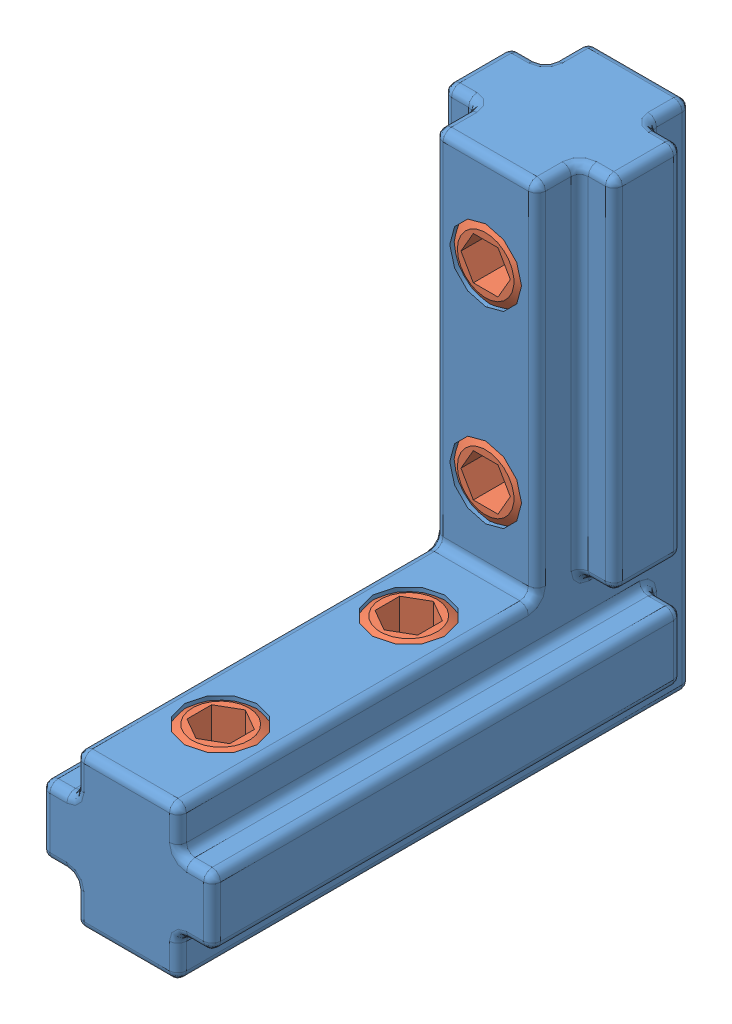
SolidWorks assembly J3RJ.SLDASM, configuration Default (file format 7000). Lengths in mm.
Overall size (10 30 30).
5 component instances, 2 part files, 8 mates.
Components (placement in the parent):
- J3RJ-1: J3RJ.SLDPRT [Default] at (-6.219 -10.7101 -13.0497) size (10 30 30)
- S0508-1: S0508.SLDPRT [Default] at (-9.219 13.7899 -4.0497) x (0 0 -1) z (1 0 0) size (8 5 5)
- S0508-2: S0508.SLDPRT [Default] at (-9.219 2.7899 -4.0497) x (0 0 -1) z (1 0 0) size (8 5 5)
- S0508-3: S0508.SLDPRT [Default] at (-9.219 -1.7101 0.4503) x (0 -1 0) z (0 0 1) size (8 5 5)
- S0508-4: S0508.SLDPRT [Default] at (-9.219 -1.7101 11.4503) x (0 -1 0) z (0 0 1) size (8 5 5)
Mates (geometry in assembly coordinates):
- 同心11: concentric aligned: cylinder of J3RJ-1 through (-9.219 13.7899 -4.0497) axis (0 0 1) radius 2.1; cylinder of S0508-1 through (-9.219 13.7899 8.6503) axis (0 0 1) radius 2.5
- 同心2: concentric aligned: cylinder of J3RJ-1 through (-9.219 2.7899 -4.0497) axis (0 0 1) radius 2.1; cylinder of S0508-2 through (-9.219 2.7899 8.6503) axis (0 0 1) radius 2.5
- 重合1: coincident aligned: plane of J3RJ-1 through (-6.219 19.2899 -4.0497) normal (0 0 1); plane of S0508-1 through (-9.219 13.7899 -4.0497) normal (0 0 1)
- 重合2: coincident aligned: plane of J3RJ-1 through (-6.219 19.2899 -4.0497) normal (0 0 1); plane of S0508-2 through (-9.219 2.7899 -4.0497) normal (0 0 1)
- 同心3: concentric aligned: cylinder of J3RJ-1 through (-9.219 -1.7101 0.4503) axis (0 1 0) radius 2.1; cylinder of S0508-3 through (-9.219 10.9899 0.4503) axis (0 1 0) radius 2.5
- 同心4: concentric aligned: cylinder of J3RJ-1 through (-9.219 -1.7101 11.4503) axis (0 1 0) radius 2.1; cylinder of S0508-4 through (-9.219 10.9899 11.4503) axis (0 1 0) radius 2.5
- 重合3: coincident aligned: plane of J3RJ-1 through (-6.219 -1.7101 16.9503) normal (0 1 0); plane of S0508-3 through (-9.219 -1.7101 0.4503) normal (0 1 0)
- 重合4: coincident aligned: plane of J3RJ-1 through (-6.219 -1.7101 16.9503) normal (0 1 0); plane of S0508-4 through (-9.219 -1.7101 11.4503) normal (0 1 0)
